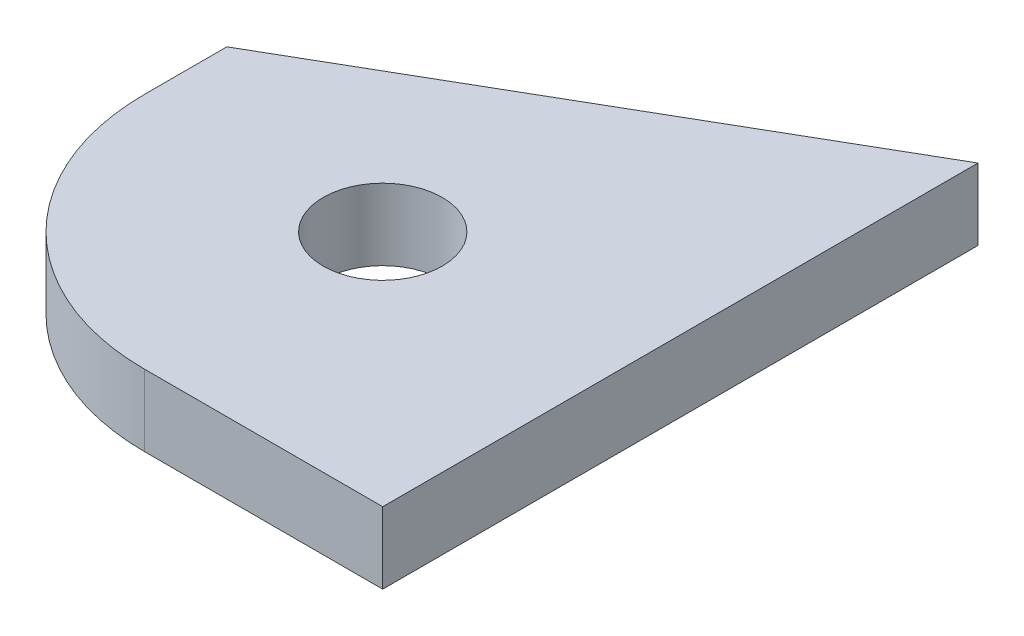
from build123d import *

# Parameters (mm, degrees)
SKETCH1_R      = 2.5
EXTRUDE1_DEPTH = 3


with BuildPart() as part:
    # Sketch1 → Extrude1 (new body)
    with BuildSketch(Plane(origin=(0, 0, 0), x_dir=(1, 0, 0), z_dir=(0, 1, 0))):
        with BuildLine():
            Line((0, 0), (0, -25))
            Line((0, -25), (-10, -25))
            ThreePointArc((-10, -25), (-17.071067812, -22.071067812), (-20, -15))
            Line((-20, -15), (-20, -11.547005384))
            Line((-20, -11.547005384), (0, 0))
        make_face()
        with Locations(Location((-10, -15, 0), (0, 0, 270))):
            Circle(SKETCH1_R, mode=Mode.SUBTRACT)
    extrude(amount=EXTRUDE1_DEPTH)


solid = part.part
